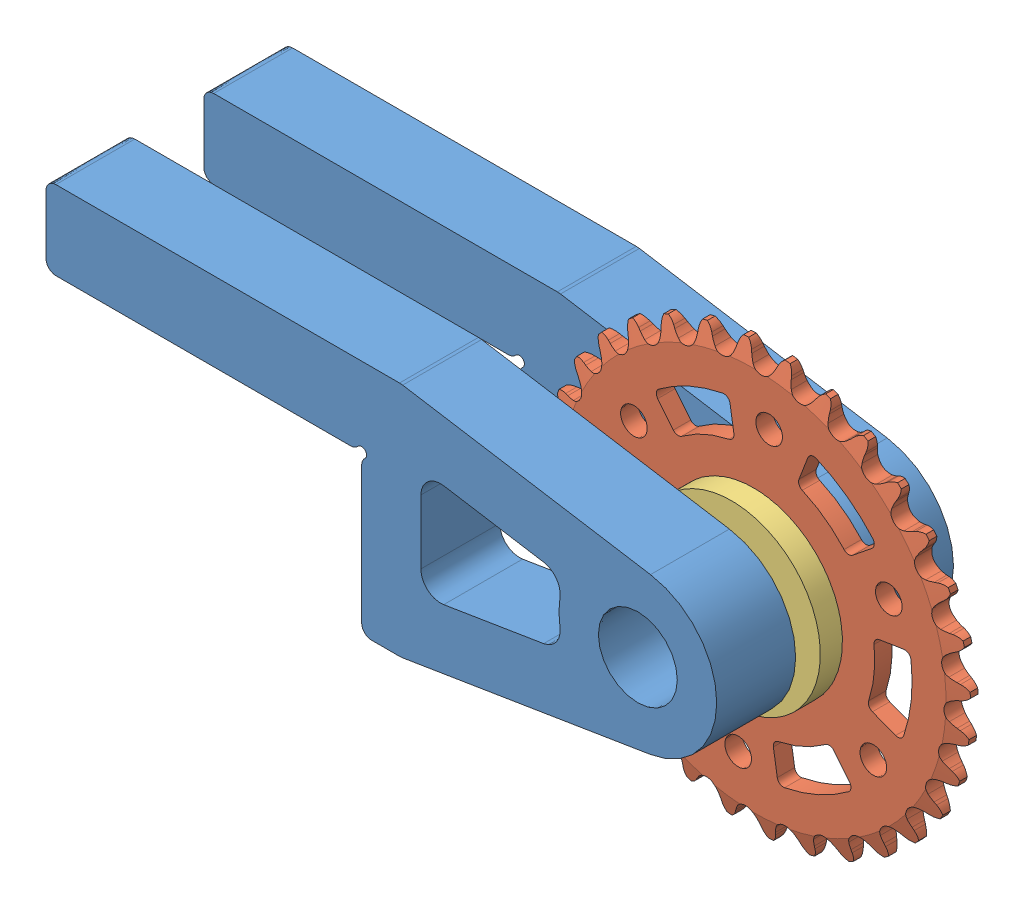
SolidWorks assembly Top of the elevator sprocket thingy.SLDASM, configuration Default (file format 7000). Lengths in mm.
Overall size (142.76 95.02 38.1).
4 component instances, 3 part files, 6 mates.
Components (placement in the parent):
- Elevator Sprocket mount-1: Elevator Sprocket mount.SLDPRT [Default] at (21.0143 40.1534 78.8991) size (107.95 38.1 12.7)
- 2_32tvexsprocket-1: 2_32tvexsprocket.SLDPRT [Default] at (90.8643 27.4534 63.8179) x (0.587875 0.808952 0) z (0 0 1) size (68.02 68.02 2.79)
- Elevator Sprocket mount-2: Elevator Sprocket mount.SLDPRT [Default] at (21.0143 40.1534 53.4991) size (107.95 38.1 12.7)
- Flanged 1.25 d bearing-1: Flanged 1.25 d bearing.SLDPRT [Default] at (90.8643 27.4534 70.1679) x (-0.975105 0.221744 0) z (-0.221744 -0.975105 0) size (31.12 7.94 31.12)
Mates (geometry in assembly coordinates):
- Coincident4: coincident anti-aligned: plane of 2_32tvexsprocket-1 through (90.8643 27.4534 63.8179) normal (0 0 -1); plane of Flanged 1.25 d bearing-1 through (75.6941 30.9032 63.8179) normal (0 0 1)
- Distance1: distance = 12.7 mm anti-aligned: plane of Elevator Sprocket mount-2 through (21.0143 40.1534 59.8491) normal (0 0 1); plane of Elevator Sprocket mount-1 through (21.0143 40.1534 72.5491) normal (0 0 -1)
- Width2: width aligned: plane of Elevator Sprocket mount-2 through (21.0143 40.1534 59.8491) normal (0 0 1); plane of Elevator Sprocket mount-1 through (21.0143 40.1534 72.5491) normal (0 0 -1); plane of Flanged 1.25 d bearing-1 through (76.9325 30.6216 70.1679) normal (0 0 1); plane of Flanged 1.25 d bearing-1 through (78.4805 30.2695 62.2304) normal (0 0 -1)
- Coincident5: coincident anti-aligned: cylinder of Elevator Sprocket mount-1 through (90.8643 27.4534 72.5491) axis (0 0 1) radius 6.35; circle of Flanged 1.25 d bearing-1
- Coincident7: coincident aligned: plane of Elevator Sprocket mount-1 through (-4.3857 46.5034 85.2491) normal (0 1 0); plane of Elevator Sprocket mount-2 through (-4.3857 46.5034 59.8491) normal (0 1 0)
- Concentric1: concentric aligned: cylinder of Elevator Sprocket mount-1 through (90.8643 27.4534 72.5491) axis (0 0 1) radius 6.35; cylinder of 2_32tvexsprocket-1 through (90.8643 27.4534 63.8179) axis (0 0 1) radius 14.3
